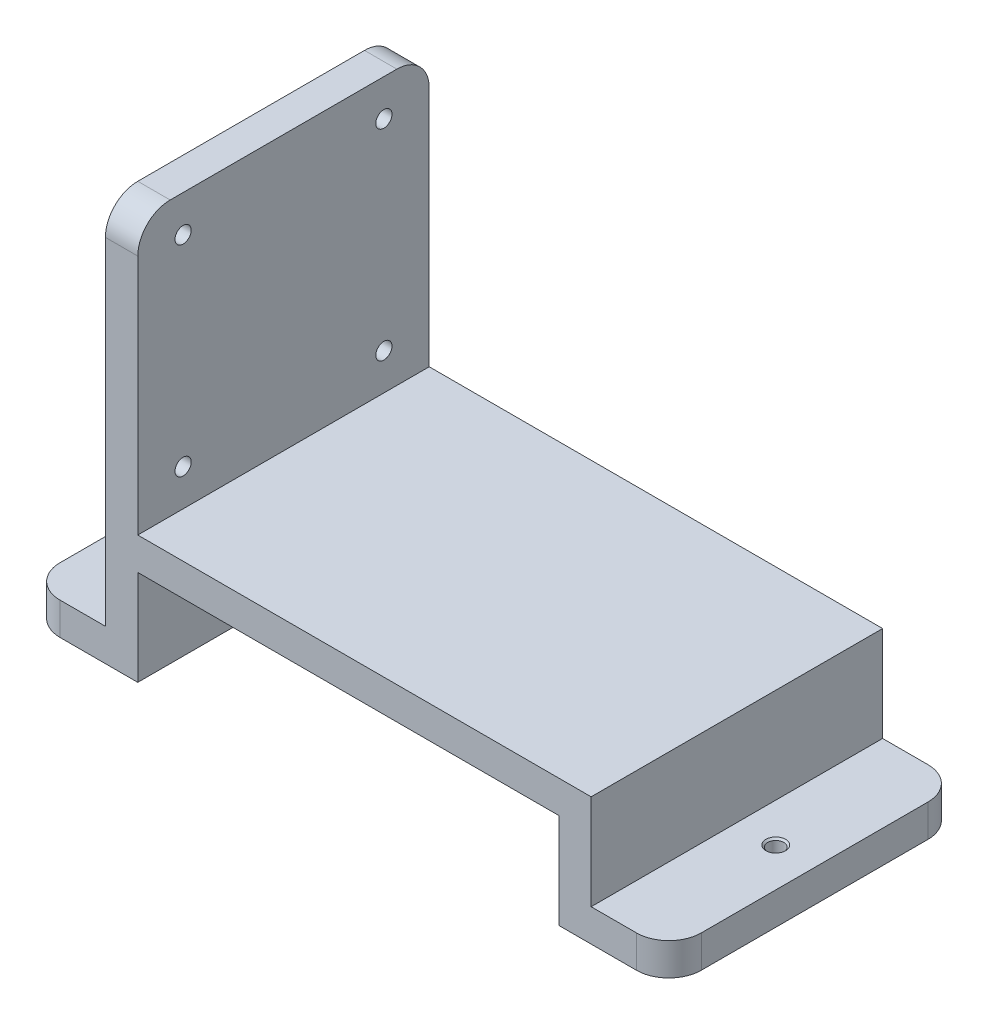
from build123d import *

# Parameters (mm, degrees)
EXTRUDE_1_DEPTH              = 45
HOLE_WIZARD_M3_2_D           = 2.5
HOLE_WIZARD_M3_2_DEPTH       = 7.5
HOLE_WIZARD_M3_2_CSINK_D     = 3.05
HOLE_WIZARD_M3_2_CSINK_ANGLE = 90
HOLE_WIZARD_M3_2_TIP         = 0.751075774
FILLET_1_R                   = 5
HOLE_WIZARD_M3_4_D           = 2.5
HOLE_WIZARD_M3_4_DEPTH       = 7.5
HOLE_WIZARD_M3_4_CSINK_D     = 3.05
HOLE_WIZARD_M3_4_CSINK_ANGLE = 90
HOLE_WIZARD_M3_4_TIP         = 0.751075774


with BuildPart() as part:
    # Sketch 1 → Extrude 1 (new body)
    with BuildSketch(Plane.XY):
        Polygon((-32.5, 0), (32.5, 0), (32.5, -14.7), (49.5, -14.7), (49.5, -9.7), (37.5, -9.7), (37.5, 5), (-32.5, 5), (-32.5, 47.3), (-37.5, 47.3), (-37.5, -9.7), (-49.5, -9.7), (-49.5, -14.7), (-32.5, -14.7), align=None)
    extrude(amount=EXTRUDE_1_DEPTH)

    # Hole Wizard M3 _2
    with Locations(Plane(origin=(0, -9.7, 0), x_dir=(1, 0, 0), z_dir=(0, 1, 0))):
        with Locations((43.5, -22.5), (-43.5, -22.5)):
            CounterSinkHole(HOLE_WIZARD_M3_2_D / 2, HOLE_WIZARD_M3_2_CSINK_D / 2, depth=HOLE_WIZARD_M3_2_DEPTH, counter_sink_angle=HOLE_WIZARD_M3_2_CSINK_ANGLE)
            with Locations((0, 0, -(HOLE_WIZARD_M3_2_DEPTH + HOLE_WIZARD_M3_2_TIP / 2))):  # 118° drill point
                Cone(0, HOLE_WIZARD_M3_2_D / 2, HOLE_WIZARD_M3_2_TIP, mode=Mode.SUBTRACT)

    # Fillet 1
    fillet_1_edges = [part.edges().sort_by_distance(p)[0] for p in [
        (49.5, -12.2, 0),
        (-49.5, -12.2, 0),
        (-35, 47.3, 0),
        (-49.5, -12.2, 45),
        (49.5, -12.2, 45),
        (-35, 47.3, 45),
    ]]
    fillet(fillet_1_edges, radius=FILLET_1_R)

    # Hole Wizard M3 _4
    with Locations(Plane.ZY.offset(37.5)):
        with Locations((7, 41.65), (7, 10.65), (38, 10.65), (38, 41.65)):
            CounterSinkHole(HOLE_WIZARD_M3_4_D / 2, HOLE_WIZARD_M3_4_CSINK_D / 2, depth=HOLE_WIZARD_M3_4_DEPTH, counter_sink_angle=HOLE_WIZARD_M3_4_CSINK_ANGLE)
            with Locations((0, 0, -(HOLE_WIZARD_M3_4_DEPTH + HOLE_WIZARD_M3_4_TIP / 2))):  # 118° drill point
                Cone(0, HOLE_WIZARD_M3_4_D / 2, HOLE_WIZARD_M3_4_TIP, mode=Mode.SUBTRACT)


solid = part.part
